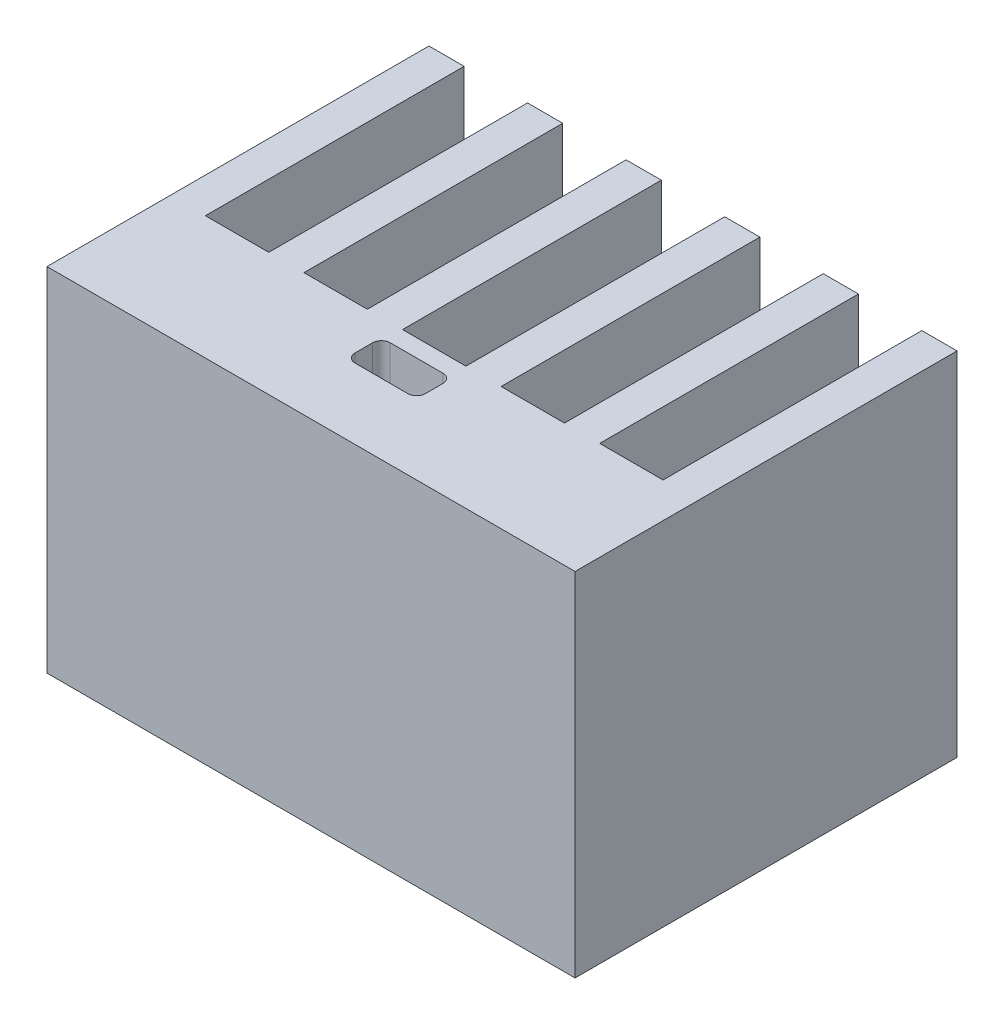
from build123d import *

# Parameters (mm, degrees)
SKETCH_1_W          = 30
SKETCH_1_H          = 20
EXTRUDE_1_DEPTH     = 7
SKETCH_2_W          = 2
SKETCH_2_H          = 20
EXTRUDE_2_DEPTH     = 14.7
SKETCH_3_W          = 4
SKETCH_3_H          = 2
CUT_EXTRUDE_1_DEPTH = 20
FILLET_1_R          = 0.5


with BuildPart() as part:
    # Sketch 1 → Extrude 1 (new body)
    with BuildSketch(Plane.XY):
        Rectangle(SKETCH_1_W, SKETCH_1_H)
    extrude(amount=EXTRUDE_1_DEPTH)

    # Sketch 2 → Extrude 2 (add)
    with BuildSketch(Plane(origin=(0, 0, 0), x_dir=(-1, 0, 0), z_dir=(0, 0, -1))):
        with Locations((-14, 0)):
            Rectangle(SKETCH_2_W, SKETCH_2_H)
        with Locations((-8.4, 0)):
            Rectangle(SKETCH_2_W, SKETCH_2_H)
        with Locations((-2.8, 0)):
            Rectangle(SKETCH_2_W, SKETCH_2_H)
        with Locations((2.8, 0)):
            Rectangle(SKETCH_2_W, SKETCH_2_H)
        with Locations((8.4, 0)):
            Rectangle(SKETCH_2_W, SKETCH_2_H)
        with Locations((14, 0)):
            Rectangle(SKETCH_2_W, SKETCH_2_H)
    extrude(amount=EXTRUDE_2_DEPTH)

    # Sketch 3 → Cut-Extrude 1 (cut)
    with BuildSketch(Plane(origin=(0, 10, 0), x_dir=(1, 0, 0), z_dir=(0, 1, 0))):
        with Locations((0, -2)):
            Rectangle(SKETCH_3_W, SKETCH_3_H)
    extrude(amount=-CUT_EXTRUDE_1_DEPTH, mode=Mode.SUBTRACT)

    # Fillet 1
    fillet_1_edges = [part.edges().sort_by_distance(p)[0] for p in [
        (-2, 0, 3),
        (-2, 0, 1),
        (2, 0, 1),
        (2, 0, 3),
    ]]
    fillet(fillet_1_edges, radius=FILLET_1_R)


solid = part.part
